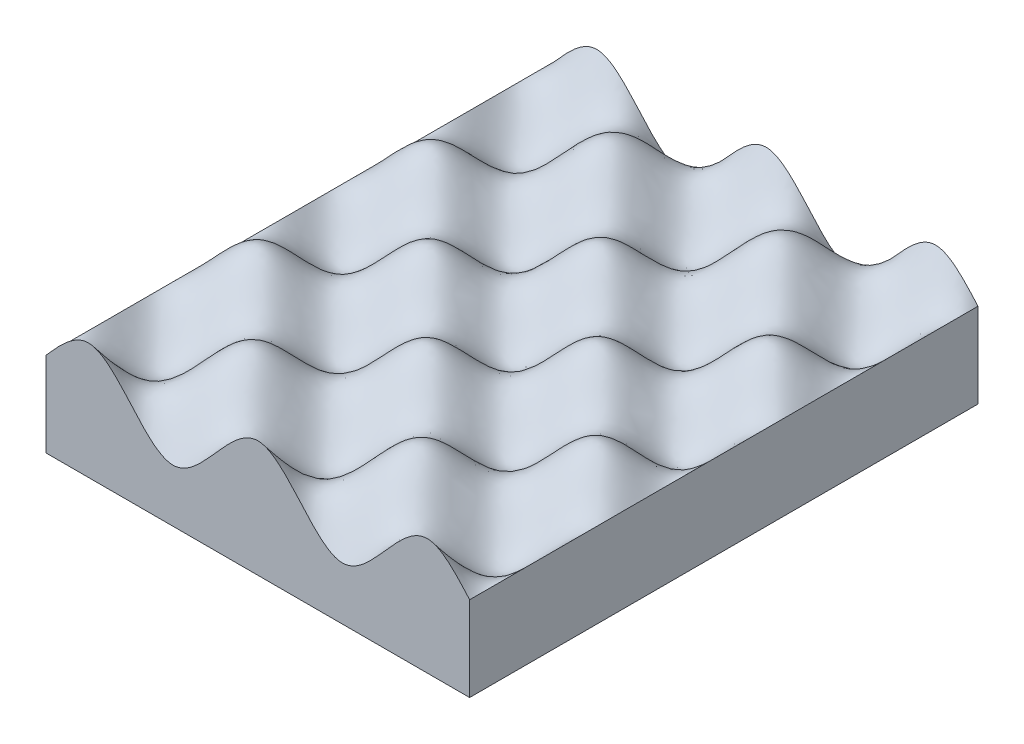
ISO-10303-21;
HEADER;
FILE_DESCRIPTION(('STEP AP214'),'2;1');
FILE_NAME('part.step','',(''),(''),'','','');
FILE_SCHEMA(('AUTOMOTIVE_DESIGN { 1 0 10303 214 1 1 1 1 }'));
ENDSEC;
DATA;
#1=APPLICATION_CONTEXT('core data for automotive mechanical design processes');
#2=APPLICATION_PROTOCOL_DEFINITION('international standard','automotive_design',2000,#1);
#3=PRODUCT_CONTEXT('',#1,'mechanical');
#4=PRODUCT('Part','Part','',(#3));
#5=PRODUCT_RELATED_PRODUCT_CATEGORY('part','',(#4));
#6=PRODUCT_DEFINITION_FORMATION('','',#4);
#7=PRODUCT_DEFINITION_CONTEXT('part definition',#1,'design');
#8=PRODUCT_DEFINITION('design','',#6,#7);
#9=PRODUCT_DEFINITION_SHAPE('','',#8);
#10=(LENGTH_UNIT() NAMED_UNIT(*) SI_UNIT(.MILLI.,.METRE.));
#11=(NAMED_UNIT(*) PLANE_ANGLE_UNIT() SI_UNIT($,.RADIAN.));
#12=(NAMED_UNIT(*) SI_UNIT($,.STERADIAN.) SOLID_ANGLE_UNIT());
#13=UNCERTAINTY_MEASURE_WITH_UNIT(LENGTH_MEASURE(1.E-05),#10,'distance_accuracy_value','');
#14=(GEOMETRIC_REPRESENTATION_CONTEXT(3) GLOBAL_UNCERTAINTY_ASSIGNED_CONTEXT((#13)) GLOBAL_UNIT_ASSIGNED_CONTEXT((#10,
#11,#12)) REPRESENTATION_CONTEXT('',''));
#15=CARTESIAN_POINT('',(0.,0.,0.));
#16=DIRECTION('',(0.,0.,1.));
#17=DIRECTION('',(1.,0.,0.));
#18=AXIS2_PLACEMENT_3D('',#15,#16,#17);
#19=CARTESIAN_POINT('',(0.,24.9125384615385,-304.8));
#20=DIRECTION('',(1.,0.,0.));
#21=DIRECTION('',(0.,0.,-1.));
#22=AXIS2_PLACEMENT_3D('',#19,#20,#21);
#23=PLANE('',#22);
#24=DIRECTION('',(0.,0.,1.));
#25=VECTOR('',#24,1.);
#26=CARTESIAN_POINT('',(0.,0.,-152.4));
#27=LINE('',#26,#25);
#28=CARTESIAN_POINT('',(0.,0.,-304.8));
#29=VERTEX_POINT('',#28);
#30=CARTESIAN_POINT('',(0.,0.,0.));
#31=VERTEX_POINT('',#30);
#32=EDGE_CURVE('E12',#29,#31,#27,.T.);
#33=ORIENTED_EDGE('',*,*,#32,.F.);
#34=DIRECTION('',(0.,-1.,0.));
#35=VECTOR('',#34,1.);
#36=CARTESIAN_POINT('',(0.,24.9125384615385,-304.8));
#37=LINE('',#36,#35);
#38=CARTESIAN_POINT('',(0.,-50.8,-304.8));
#39=VERTEX_POINT('',#38);
#40=EDGE_CURVE('E52',#29,#39,#37,.T.);
#41=ORIENTED_EDGE('',*,*,#40,.T.);
#42=DIRECTION('',(0.,0.,1.));
#43=VECTOR('',#42,1.);
#44=CARTESIAN_POINT('',(0.,-50.8,-304.8));
#45=LINE('',#44,#43);
#46=CARTESIAN_POINT('',(0.,-50.8,0.));
#47=VERTEX_POINT('',#46);
#48=EDGE_CURVE('E97',#39,#47,#45,.T.);
#49=ORIENTED_EDGE('',*,*,#48,.T.);
#50=DIRECTION('',(0.,-1.,0.));
#51=VECTOR('',#50,1.);
#52=CARTESIAN_POINT('',(0.,24.9125384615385,0.));
#53=LINE('',#52,#51);
#54=EDGE_CURVE('E87',#31,#47,#53,.T.);
#55=ORIENTED_EDGE('',*,*,#54,.F.);
#56=EDGE_LOOP('',(#33,#41,#49,#55));
#57=FACE_BOUND('',#56,.T.);
#58=ADVANCED_FACE('F46',(#57),#23,.F.);
#59=CARTESIAN_POINT('',(0.,24.9125384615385,0.));
#60=DIRECTION('',(0.,0.,-1.));
#61=DIRECTION('',(-1.,0.,0.));
#62=AXIS2_PLACEMENT_3D('',#59,#60,#61);
#63=PLANE('',#62);
#64=CARTESIAN_POINT('',(0.,0.,0.));
#65=CARTESIAN_POINT('',(8.46666666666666,9.525,0.));
#66=CARTESIAN_POINT('',(33.8666666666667,38.1,0.));
#67=CARTESIAN_POINT('',(76.2,-57.15,0.));
#68=CARTESIAN_POINT('',(127.,57.15,0.));
#69=CARTESIAN_POINT('',(177.8,-57.15,0.));
#70=CARTESIAN_POINT('',(220.133333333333,38.1,0.));
#71=CARTESIAN_POINT('',(245.533333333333,9.52500000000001,0.));
#72=CARTESIAN_POINT('',(254.,0.,0.));
#73=B_SPLINE_CURVE_WITH_KNOTS('',3,(#64,#65,#66,#67,#68,#69,#70,#71,#72),.UNSPECIFIED.,.F.,.F.,
(4,1,1,1,1,1,4),(0.,0.1,0.3,0.5,0.7,0.9,1.),.UNSPECIFIED.);
#74=CARTESIAN_POINT('',(254.,0.,0.));
#75=VERTEX_POINT('',#74);
#76=EDGE_CURVE('E93',#31,#75,#73,.T.);
#77=ORIENTED_EDGE('',*,*,#76,.F.);
#78=ORIENTED_EDGE('',*,*,#54,.T.);
#79=DIRECTION('',(1.,0.,0.));
#80=VECTOR('',#79,1.);
#81=CARTESIAN_POINT('',(0.,-50.8,0.));
#82=LINE('',#81,#80);
#83=CARTESIAN_POINT('',(254.,-50.8,0.));
#84=VERTEX_POINT('',#83);
#85=EDGE_CURVE('E106',#47,#84,#82,.T.);
#86=ORIENTED_EDGE('',*,*,#85,.T.);
#87=DIRECTION('',(0.,-1.,0.));
#88=VECTOR('',#87,1.);
#89=CARTESIAN_POINT('',(254.,24.9125384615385,0.));
#90=LINE('',#89,#88);
#91=EDGE_CURVE('E127',#75,#84,#90,.T.);
#92=ORIENTED_EDGE('',*,*,#91,.F.);
#93=EDGE_LOOP('',(#77,#78,#86,#92));
#94=FACE_BOUND('',#93,.T.);
#95=ADVANCED_FACE('F131',(#94),#63,.F.);
#96=CARTESIAN_POINT('',(254.,24.9125384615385,0.));
#97=DIRECTION('',(-1.,0.,0.));
#98=DIRECTION('',(0.,0.,1.));
#99=AXIS2_PLACEMENT_3D('',#96,#97,#98);
#100=PLANE('',#99);
#101=DIRECTION('',(0.,0.,-1.));
#102=VECTOR('',#101,1.);
#103=CARTESIAN_POINT('',(254.,0.,-152.4));
#104=LINE('',#103,#102);
#105=CARTESIAN_POINT('',(254.,0.,-304.8));
#106=VERTEX_POINT('',#105);
#107=EDGE_CURVE('E112',#75,#106,#104,.T.);
#108=ORIENTED_EDGE('',*,*,#107,.F.);
#109=ORIENTED_EDGE('',*,*,#91,.T.);
#110=DIRECTION('',(0.,0.,-1.));
#111=VECTOR('',#110,1.);
#112=CARTESIAN_POINT('',(254.,-50.8,0.));
#113=LINE('',#112,#111);
#114=CARTESIAN_POINT('',(254.,-50.8,-304.8));
#115=VERTEX_POINT('',#114);
#116=EDGE_CURVE('E128',#84,#115,#113,.T.);
#117=ORIENTED_EDGE('',*,*,#116,.T.);
#118=DIRECTION('',(0.,-1.,0.));
#119=VECTOR('',#118,1.);
#120=CARTESIAN_POINT('',(254.,24.9125384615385,-304.8));
#121=LINE('',#120,#119);
#122=EDGE_CURVE('E70',#106,#115,#121,.T.);
#123=ORIENTED_EDGE('',*,*,#122,.F.);
#124=EDGE_LOOP('',(#108,#109,#117,#123));
#125=FACE_BOUND('',#124,.T.);
#126=ADVANCED_FACE('F130',(#125),#100,.F.);
#127=CARTESIAN_POINT('',(254.,24.9125384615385,-304.8));
#128=DIRECTION('',(0.,0.,1.));
#129=DIRECTION('',(1.,0.,0.));
#130=AXIS2_PLACEMENT_3D('',#127,#128,#129);
#131=PLANE('',#130);
#132=CARTESIAN_POINT('',(0.,0.,-304.8));
#133=CARTESIAN_POINT('',(8.46666666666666,9.525,-304.8));
#134=CARTESIAN_POINT('',(33.8666666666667,38.1,-304.8));
#135=CARTESIAN_POINT('',(76.2,-57.15,-304.8));
#136=CARTESIAN_POINT('',(127.,57.15,-304.8));
#137=CARTESIAN_POINT('',(177.8,-57.15,-304.8));
#138=CARTESIAN_POINT('',(220.133333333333,38.1,-304.8));
#139=CARTESIAN_POINT('',(245.533333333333,9.52500000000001,-304.8));
#140=CARTESIAN_POINT('',(254.,0.,-304.8));
#141=B_SPLINE_CURVE_WITH_KNOTS('',3,(#132,#133,#134,#135,#136,#137,#138,#139,#140),
.UNSPECIFIED.,.F.,.F.,(4,1,1,1,1,1,4),(0.,0.1,0.3,0.5,0.7,0.9,1.),.UNSPECIFIED.);
#142=EDGE_CURVE('E57',#106,#29,#141,.F.);
#143=ORIENTED_EDGE('',*,*,#142,.F.);
#144=ORIENTED_EDGE('',*,*,#122,.T.);
#145=DIRECTION('',(-1.,0.,0.));
#146=VECTOR('',#145,1.);
#147=CARTESIAN_POINT('',(254.,-50.8,-304.8));
#148=LINE('',#147,#146);
#149=EDGE_CURVE('E100',#115,#39,#148,.T.);
#150=ORIENTED_EDGE('',*,*,#149,.T.);
#151=ORIENTED_EDGE('',*,*,#40,.F.);
#152=EDGE_LOOP('',(#143,#144,#150,#151));
#153=FACE_BOUND('',#152,.T.);
#154=ADVANCED_FACE('F101',(#153),#131,.F.);
#155=CARTESIAN_POINT('',(0.,-50.8,0.));
#156=DIRECTION('',(0.,1.,0.));
#157=DIRECTION('',(0.,0.,1.));
#158=AXIS2_PLACEMENT_3D('',#155,#156,#157);
#159=PLANE('',#158);
#160=ORIENTED_EDGE('',*,*,#48,.F.);
#161=ORIENTED_EDGE('',*,*,#149,.F.);
#162=ORIENTED_EDGE('',*,*,#116,.F.);
#163=ORIENTED_EDGE('',*,*,#85,.F.);
#164=EDGE_LOOP('',(#160,#161,#162,#163));
#165=FACE_BOUND('',#164,.T.);
#166=ADVANCED_FACE('F105',(#165),#159,.F.);
#167=CARTESIAN_POINT('',(0.,0.,0.));
#168=CARTESIAN_POINT('',(0.,0.,-16.9333333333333));
#169=CARTESIAN_POINT('',(0.,0.,-50.8));
#170=CARTESIAN_POINT('',(0.,0.,-101.6));
#171=CARTESIAN_POINT('',(0.,0.,-152.4));
#172=CARTESIAN_POINT('',(0.,0.,-203.2));
#173=CARTESIAN_POINT('',(0.,0.,-254.));
#174=CARTESIAN_POINT('',(0.,0.,-287.866666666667));
#175=CARTESIAN_POINT('',(0.,0.,-304.8));
#176=CARTESIAN_POINT('',(8.46666666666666,9.525,0.));
#177=CARTESIAN_POINT('',(8.46666666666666,-1.46538461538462,-16.9333333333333));
#178=CARTESIAN_POINT('',(8.46666666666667,-23.4461538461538,-50.8));
#179=CARTESIAN_POINT('',(8.46666666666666,27.1096153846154,-101.6));
#180=CARTESIAN_POINT('',(8.46666666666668,-27.8423076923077,-152.4));
#181=CARTESIAN_POINT('',(8.46666666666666,27.1096153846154,-203.2));
#182=CARTESIAN_POINT('',(8.46666666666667,-23.4461538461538,-254.));
#183=CARTESIAN_POINT('',(8.46666666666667,-1.46538461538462,-287.866666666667));
#184=CARTESIAN_POINT('',(8.46666666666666,9.525,-304.8));
#185=CARTESIAN_POINT('',(33.8666666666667,38.1,0.));
#186=CARTESIAN_POINT('',(33.8666666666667,-5.86153846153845,-16.9333333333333));
#187=CARTESIAN_POINT('',(33.8666666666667,-93.7846153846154,-50.8));
#188=CARTESIAN_POINT('',(33.8666666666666,108.438461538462,-101.6));
#189=CARTESIAN_POINT('',(33.8666666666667,-111.369230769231,-152.4));
#190=CARTESIAN_POINT('',(33.8666666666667,108.438461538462,-203.2));
#191=CARTESIAN_POINT('',(33.8666666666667,-93.7846153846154,-254.));
#192=CARTESIAN_POINT('',(33.8666666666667,-5.86153846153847,-287.866666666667));
#193=CARTESIAN_POINT('',(33.8666666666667,38.1,-304.8));
#194=CARTESIAN_POINT('',(76.2,-57.15,0.));
#195=CARTESIAN_POINT('',(76.2,8.79230769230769,-16.9333333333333));
#196=CARTESIAN_POINT('',(76.2,140.676923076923,-50.8));
#197=CARTESIAN_POINT('',(76.2,-162.657692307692,-101.6));
#198=CARTESIAN_POINT('',(76.2,167.053846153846,-152.4));
#199=CARTESIAN_POINT('',(76.2,-162.657692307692,-203.2));
#200=CARTESIAN_POINT('',(76.2,140.676923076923,-254.));
#201=CARTESIAN_POINT('',(76.2,8.79230769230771,-287.866666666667));
#202=CARTESIAN_POINT('',(76.2,-57.15,-304.8));
#203=CARTESIAN_POINT('',(127.,57.15,0.));
#204=CARTESIAN_POINT('',(127.,-8.79230769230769,-16.9333333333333));
#205=CARTESIAN_POINT('',(127.,-140.676923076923,-50.8));
#206=CARTESIAN_POINT('',(127.,162.657692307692,-101.6));
#207=CARTESIAN_POINT('',(127.,-167.053846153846,-152.4));
#208=CARTESIAN_POINT('',(127.,162.657692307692,-203.2));
#209=CARTESIAN_POINT('',(127.,-140.676923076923,-254.));
#210=CARTESIAN_POINT('',(127.,-8.79230769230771,-287.866666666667));
#211=CARTESIAN_POINT('',(127.,57.15,-304.8));
#212=CARTESIAN_POINT('',(177.8,-57.15,0.));
#213=CARTESIAN_POINT('',(177.8,8.79230769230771,-16.9333333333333));
#214=CARTESIAN_POINT('',(177.8,140.676923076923,-50.8));
#215=CARTESIAN_POINT('',(177.8,-162.657692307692,-101.6));
#216=CARTESIAN_POINT('',(177.8,167.053846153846,-152.4));
#217=CARTESIAN_POINT('',(177.8,-162.657692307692,-203.2));
#218=CARTESIAN_POINT('',(177.8,140.676923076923,-254.));
#219=CARTESIAN_POINT('',(177.8,8.79230769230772,-287.866666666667));
#220=CARTESIAN_POINT('',(177.8,-57.15,-304.8));
#221=CARTESIAN_POINT('',(220.133333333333,38.1,0.));
#222=CARTESIAN_POINT('',(220.133333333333,-5.86153846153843,-16.9333333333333));
#223=CARTESIAN_POINT('',(220.133333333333,-93.7846153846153,-50.8));
#224=CARTESIAN_POINT('',(220.133333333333,108.438461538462,-101.6));
#225=CARTESIAN_POINT('',(220.133333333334,-111.369230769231,-152.4));
#226=CARTESIAN_POINT('',(220.133333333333,108.438461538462,-203.2));
#227=CARTESIAN_POINT('',(220.133333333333,-93.7846153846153,-254.));
#228=CARTESIAN_POINT('',(220.133333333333,-5.86153846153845,-287.866666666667));
#229=CARTESIAN_POINT('',(220.133333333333,38.1,-304.8));
#230=CARTESIAN_POINT('',(245.533333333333,9.52500000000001,0.));
#231=CARTESIAN_POINT('',(245.533333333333,-1.46538461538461,-16.9333333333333));
#232=CARTESIAN_POINT('',(245.533333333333,-23.4461538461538,-50.8));
#233=CARTESIAN_POINT('',(245.533333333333,27.1096153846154,-101.6));
#234=CARTESIAN_POINT('',(245.533333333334,-27.8423076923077,-152.4));
#235=CARTESIAN_POINT('',(245.533333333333,27.1096153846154,-203.2));
#236=CARTESIAN_POINT('',(245.533333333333,-23.4461538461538,-254.));
#237=CARTESIAN_POINT('',(245.533333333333,-1.46538461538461,-287.866666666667));
#238=CARTESIAN_POINT('',(245.533333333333,9.52500000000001,-304.8));
#239=CARTESIAN_POINT('',(254.,0.,0.));
#240=CARTESIAN_POINT('',(254.,0.,-16.9333333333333));
#241=CARTESIAN_POINT('',(254.,0.,-50.8));
#242=CARTESIAN_POINT('',(254.,0.,-101.6));
#243=CARTESIAN_POINT('',(254.,0.,-152.4));
#244=CARTESIAN_POINT('',(254.,0.,-203.2));
#245=CARTESIAN_POINT('',(254.,0.,-254.));
#246=CARTESIAN_POINT('',(254.,0.,-287.866666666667));
#247=CARTESIAN_POINT('',(254.,0.,-304.8));
#248=B_SPLINE_SURFACE_WITH_KNOTS('',3,3,((#167,#168,#169,#170,#171,#172,#173,#174,#175),(#176,
#177,#178,#179,#180,#181,#182,#183,#184),(#185,#186,#187,#188,#189,#190,#191,#192,#193),(#194,
#195,#196,#197,#198,#199,#200,#201,#202),(#203,#204,#205,#206,#207,#208,#209,#210,#211),(#212,
#213,#214,#215,#216,#217,#218,#219,#220),(#221,#222,#223,#224,#225,#226,#227,#228,#229),(#230,
#231,#232,#233,#234,#235,#236,#237,#238),(#239,#240,#241,#242,#243,#244,#245,#246,#247)),
.UNSPECIFIED.,.F.,.F.,.F.,(4,1,1,1,1,1,4),(4,1,1,1,1,1,4),(0.,0.1,0.3,0.5,0.7,0.9,1.),(0.,
0.166666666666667,0.333333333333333,0.5,0.666666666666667,0.833333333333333,1.),.UNSPECIFIED.);
#249=ORIENTED_EDGE('',*,*,#76,.T.);
#250=ORIENTED_EDGE('',*,*,#107,.T.);
#251=ORIENTED_EDGE('',*,*,#142,.T.);
#252=ORIENTED_EDGE('',*,*,#32,.T.);
#253=EDGE_LOOP('',(#249,#250,#251,#252));
#254=FACE_BOUND('',#253,.T.);
#255=ADVANCED_FACE('F48',(#254),#248,.T.);
#256=CLOSED_SHELL('',(#58,#95,#126,#154,#166,#255));
#257=MANIFOLD_SOLID_BREP('B2',#256);
#258=ADVANCED_BREP_SHAPE_REPRESENTATION('',(#18,#257),#14);
#259=SHAPE_DEFINITION_REPRESENTATION(#9,#258);
ENDSEC;
END-ISO-10303-21;
